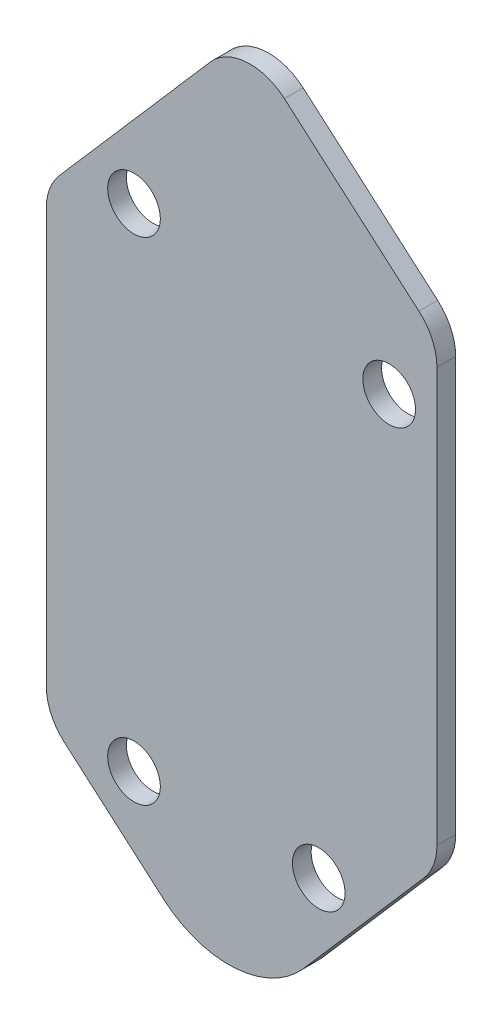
ISO-10303-21;
HEADER;
FILE_DESCRIPTION(('STEP AP214'),'2;1');
FILE_NAME('part.step','',(''),(''),'','','');
FILE_SCHEMA(('AUTOMOTIVE_DESIGN { 1 0 10303 214 1 1 1 1 }'));
ENDSEC;
DATA;
#1=APPLICATION_CONTEXT('core data for automotive mechanical design processes');
#2=APPLICATION_PROTOCOL_DEFINITION('international standard','automotive_design',2000,#1);
#3=PRODUCT_CONTEXT('',#1,'mechanical');
#4=PRODUCT('Part','Part','',(#3));
#5=PRODUCT_RELATED_PRODUCT_CATEGORY('part','',(#4));
#6=PRODUCT_DEFINITION_FORMATION('','',#4);
#7=PRODUCT_DEFINITION_CONTEXT('part definition',#1,'design');
#8=PRODUCT_DEFINITION('design','',#6,#7);
#9=PRODUCT_DEFINITION_SHAPE('','',#8);
#10=(LENGTH_UNIT() NAMED_UNIT(*) SI_UNIT(.MILLI.,.METRE.));
#11=(NAMED_UNIT(*) PLANE_ANGLE_UNIT() SI_UNIT($,.RADIAN.));
#12=(NAMED_UNIT(*) SI_UNIT($,.STERADIAN.) SOLID_ANGLE_UNIT());
#13=UNCERTAINTY_MEASURE_WITH_UNIT(LENGTH_MEASURE(1.E-05),#10,'distance_accuracy_value','');
#14=(GEOMETRIC_REPRESENTATION_CONTEXT(3) GLOBAL_UNCERTAINTY_ASSIGNED_CONTEXT((#13)) GLOBAL_UNIT_ASSIGNED_CONTEXT((#10,
#11,#12)) REPRESENTATION_CONTEXT('',''));
#15=CARTESIAN_POINT('',(0.,0.,0.));
#16=DIRECTION('',(0.,0.,1.));
#17=DIRECTION('',(1.,0.,0.));
#18=AXIS2_PLACEMENT_3D('',#15,#16,#17);
#19=CARTESIAN_POINT('',(-783.463,-50.7534898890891,84.6582));
#20=DIRECTION('',(0.,0.,-1.));
#21=DIRECTION('',(-1.,0.,0.));
#22=AXIS2_PLACEMENT_3D('',#19,#20,#21);
#23=CYLINDRICAL_SURFACE('',#22,7.11199999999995);
#24=CARTESIAN_POINT('',(-783.463,-50.7534898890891,82.1182));
#25=DIRECTION('',(0.,0.,-1.));
#26=DIRECTION('',(-1.,0.,0.));
#27=AXIS2_PLACEMENT_3D('',#24,#25,#26);
#28=CIRCLE('',#27,7.11199999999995);
#29=CARTESIAN_POINT('',(-776.351,-50.7534898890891,82.1182));
#30=VERTEX_POINT('',#29);
#31=CARTESIAN_POINT('',(-778.093225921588,-55.4167580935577,82.1182));
#32=VERTEX_POINT('',#31);
#33=EDGE_CURVE('E175',#30,#32,#28,.T.);
#34=ORIENTED_EDGE('',*,*,#33,.F.);
#35=DIRECTION('',(0.,0.,-1.));
#36=VECTOR('',#35,1.);
#37=CARTESIAN_POINT('',(-776.351,-50.7534898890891,84.6582));
#38=LINE('',#37,#36);
#39=CARTESIAN_POINT('',(-776.351,-50.7534898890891,84.6582));
#40=VERTEX_POINT('',#39);
#41=EDGE_CURVE('E11',#40,#30,#38,.T.);
#42=ORIENTED_EDGE('',*,*,#41,.F.);
#43=CARTESIAN_POINT('',(-783.463,-50.7534898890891,84.6582));
#44=DIRECTION('',(0.,0.,-1.));
#45=DIRECTION('',(-1.,0.,0.));
#46=AXIS2_PLACEMENT_3D('',#43,#44,#45);
#47=CIRCLE('',#46,7.11199999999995);
#48=CARTESIAN_POINT('',(-778.093225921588,-55.4167580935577,84.6582));
#49=VERTEX_POINT('',#48);
#50=EDGE_CURVE('E220',#40,#49,#47,.T.);
#51=ORIENTED_EDGE('',*,*,#50,.T.);
#52=DIRECTION('',(0.,0.,-1.));
#53=VECTOR('',#52,1.);
#54=CARTESIAN_POINT('',(-778.093225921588,-55.4167580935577,84.6582));
#55=LINE('',#54,#53);
#56=EDGE_CURVE('E50',#49,#32,#55,.T.);
#57=ORIENTED_EDGE('',*,*,#56,.T.);
#58=EDGE_LOOP('',(#34,#42,#51,#57));
#59=FACE_BOUND('',#58,.T.);
#60=ADVANCED_FACE('F47',(#59),#23,.T.);
#61=CARTESIAN_POINT('',(-776.351,5.39033140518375,84.6582));
#62=DIRECTION('',(1.,0.,0.));
#63=DIRECTION('',(0.,1.,0.));
#64=AXIS2_PLACEMENT_3D('',#61,#62,#63);
#65=PLANE('',#64);
#66=DIRECTION('',(0.,-1.,0.));
#67=VECTOR('',#66,1.);
#68=CARTESIAN_POINT('',(-776.351,5.39033140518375,82.1182));
#69=LINE('',#68,#67);
#70=CARTESIAN_POINT('',(-776.351,5.39033140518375,82.1182));
#71=VERTEX_POINT('',#70);
#72=EDGE_CURVE('E217',#71,#30,#69,.T.);
#73=ORIENTED_EDGE('',*,*,#72,.F.);
#74=DIRECTION('',(0.,0.,-1.));
#75=VECTOR('',#74,1.);
#76=CARTESIAN_POINT('',(-776.351,5.39033140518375,84.6582));
#77=LINE('',#76,#75);
#78=CARTESIAN_POINT('',(-776.351,5.39033140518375,84.6582));
#79=VERTEX_POINT('',#78);
#80=EDGE_CURVE('E57',#79,#71,#77,.T.);
#81=ORIENTED_EDGE('',*,*,#80,.F.);
#82=DIRECTION('',(0.,-1.,0.));
#83=VECTOR('',#82,1.);
#84=CARTESIAN_POINT('',(-776.351,5.39033140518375,84.6582));
#85=LINE('',#84,#83);
#86=EDGE_CURVE('E160',#79,#40,#85,.T.);
#87=ORIENTED_EDGE('',*,*,#86,.T.);
#88=ORIENTED_EDGE('',*,*,#41,.T.);
#89=EDGE_LOOP('',(#73,#81,#87,#88));
#90=FACE_BOUND('',#89,.T.);
#91=ADVANCED_FACE('F252',(#90),#65,.T.);
#92=CARTESIAN_POINT('',(-783.463,5.39033140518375,84.6582));
#93=DIRECTION('',(0.,0.,-1.));
#94=DIRECTION('',(-1.,0.,0.));
#95=AXIS2_PLACEMENT_3D('',#92,#93,#94);
#96=CYLINDRICAL_SURFACE('',#95,7.11199999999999);
#97=CARTESIAN_POINT('',(-783.463,5.39033140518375,82.1182));
#98=DIRECTION('',(0.,0.,-1.));
#99=DIRECTION('',(-1.,0.,0.));
#100=AXIS2_PLACEMENT_3D('',#97,#98,#99);
#101=CIRCLE('',#100,7.11199999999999);
#102=CARTESIAN_POINT('',(-778.799731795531,10.7601054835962,82.1182));
#103=VERTEX_POINT('',#102);
#104=EDGE_CURVE('E146',#103,#71,#101,.T.);
#105=ORIENTED_EDGE('',*,*,#104,.F.);
#106=DIRECTION('',(0.,0.,-1.));
#107=VECTOR('',#106,1.);
#108=CARTESIAN_POINT('',(-778.799731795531,10.7601054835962,84.6582));
#109=LINE('',#108,#107);
#110=CARTESIAN_POINT('',(-778.799731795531,10.7601054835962,84.6582));
#111=VERTEX_POINT('',#110);
#112=EDGE_CURVE('E141',#111,#103,#109,.T.);
#113=ORIENTED_EDGE('',*,*,#112,.F.);
#114=CARTESIAN_POINT('',(-783.463,5.39033140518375,84.6582));
#115=DIRECTION('',(0.,0.,-1.));
#116=DIRECTION('',(-1.,0.,0.));
#117=AXIS2_PLACEMENT_3D('',#114,#115,#116);
#118=CIRCLE('',#117,7.11199999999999);
#119=EDGE_CURVE('E144',#111,#79,#118,.T.);
#120=ORIENTED_EDGE('',*,*,#119,.T.);
#121=ORIENTED_EDGE('',*,*,#80,.T.);
#122=EDGE_LOOP('',(#105,#113,#120,#121));
#123=FACE_BOUND('',#122,.T.);
#124=ADVANCED_FACE('F143',(#123),#96,.T.);
#125=CARTESIAN_POINT('',(-797.031481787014,26.5930881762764,84.6582));
#126=DIRECTION('',(0.655690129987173,0.755030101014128,0.));
#127=DIRECTION('',(-0.755030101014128,0.655690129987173,0.));
#128=AXIS2_PLACEMENT_3D('',#125,#126,#127);
#129=PLANE('',#128);
#130=DIRECTION('',(0.755030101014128,-0.655690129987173,0.));
#131=VECTOR('',#130,1.);
#132=CARTESIAN_POINT('',(-797.031481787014,26.5930881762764,82.1182));
#133=LINE('',#132,#131);
#134=CARTESIAN_POINT('',(-797.031481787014,26.5930881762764,82.1182));
#135=VERTEX_POINT('',#134);
#136=EDGE_CURVE('E212',#135,#103,#133,.T.);
#137=ORIENTED_EDGE('',*,*,#136,.F.);
#138=DIRECTION('',(0.,0.,-1.));
#139=VECTOR('',#138,1.);
#140=CARTESIAN_POINT('',(-797.031481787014,26.5930881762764,84.6582));
#141=LINE('',#140,#139);
#142=CARTESIAN_POINT('',(-797.031481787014,26.5930881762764,84.6582));
#143=VERTEX_POINT('',#142);
#144=EDGE_CURVE('E152',#143,#135,#141,.T.);
#145=ORIENTED_EDGE('',*,*,#144,.F.);
#146=DIRECTION('',(0.755030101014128,-0.655690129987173,0.));
#147=VECTOR('',#146,1.);
#148=CARTESIAN_POINT('',(-797.031481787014,26.5930881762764,84.6582));
#149=LINE('',#148,#147);
#150=EDGE_CURVE('E158',#143,#111,#149,.T.);
#151=ORIENTED_EDGE('',*,*,#150,.T.);
#152=ORIENTED_EDGE('',*,*,#112,.T.);
#153=EDGE_LOOP('',(#137,#145,#151,#152));
#154=FACE_BOUND('',#153,.T.);
#155=ADVANCED_FACE('F163',(#154),#129,.T.);
#156=CARTESIAN_POINT('',(-801.694749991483,21.2233140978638,84.6582));
#157=DIRECTION('',(0.,0.,-1.));
#158=DIRECTION('',(-1.,0.,0.));
#159=AXIS2_PLACEMENT_3D('',#156,#157,#158);
#160=CYLINDRICAL_SURFACE('',#159,7.11200000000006);
#161=CARTESIAN_POINT('',(-801.694749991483,21.2233140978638,82.1182));
#162=DIRECTION('',(0.,0.,-1.));
#163=DIRECTION('',(-1.,0.,0.));
#164=AXIS2_PLACEMENT_3D('',#161,#162,#163);
#165=CIRCLE('',#164,7.11200000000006);
#166=CARTESIAN_POINT('',(-807.064524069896,25.8865823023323,82.1182));
#167=VERTEX_POINT('',#166);
#168=EDGE_CURVE('E208',#167,#135,#165,.T.);
#169=ORIENTED_EDGE('',*,*,#168,.F.);
#170=DIRECTION('',(0.,0.,-1.));
#171=VECTOR('',#170,1.);
#172=CARTESIAN_POINT('',(-807.064524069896,25.8865823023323,84.6582));
#173=LINE('',#172,#171);
#174=CARTESIAN_POINT('',(-807.064524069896,25.8865823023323,84.6582));
#175=VERTEX_POINT('',#174);
#176=EDGE_CURVE('E226',#175,#167,#173,.T.);
#177=ORIENTED_EDGE('',*,*,#176,.F.);
#178=CARTESIAN_POINT('',(-801.694749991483,21.2233140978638,84.6582));
#179=DIRECTION('',(0.,0.,-1.));
#180=DIRECTION('',(-1.,0.,0.));
#181=AXIS2_PLACEMENT_3D('',#178,#179,#180);
#182=CIRCLE('',#181,7.11200000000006);
#183=EDGE_CURVE('E165',#175,#143,#182,.T.);
#184=ORIENTED_EDGE('',*,*,#183,.T.);
#185=ORIENTED_EDGE('',*,*,#144,.T.);
#186=EDGE_LOOP('',(#169,#177,#184,#185));
#187=FACE_BOUND('',#186,.T.);
#188=ADVANCED_FACE('F265',(#187),#160,.T.);
#189=CARTESIAN_POINT('',(-827.567774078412,2.27699872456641,84.6582));
#190=DIRECTION('',(-0.755030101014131,0.655690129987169,0.));
#191=DIRECTION('',(-0.655690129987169,-0.755030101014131,0.));
#192=AXIS2_PLACEMENT_3D('',#189,#190,#191);
#193=PLANE('',#192);
#194=DIRECTION('',(0.655690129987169,0.755030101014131,0.));
#195=VECTOR('',#194,1.);
#196=CARTESIAN_POINT('',(-827.567774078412,2.27699872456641,82.1182));
#197=LINE('',#196,#195);
#198=CARTESIAN_POINT('',(-827.567774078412,2.27699872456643,82.1182));
#199=VERTEX_POINT('',#198);
#200=EDGE_CURVE('E204',#199,#167,#197,.T.);
#201=ORIENTED_EDGE('',*,*,#200,.F.);
#202=DIRECTION('',(0.,0.,-1.));
#203=VECTOR('',#202,1.);
#204=CARTESIAN_POINT('',(-827.567774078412,2.27699872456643,84.6582));
#205=LINE('',#204,#203);
#206=CARTESIAN_POINT('',(-827.567774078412,2.27699872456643,84.6582));
#207=VERTEX_POINT('',#206);
#208=EDGE_CURVE('E229',#207,#199,#205,.T.);
#209=ORIENTED_EDGE('',*,*,#208,.F.);
#210=DIRECTION('',(0.655690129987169,0.755030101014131,0.));
#211=VECTOR('',#210,1.);
#212=CARTESIAN_POINT('',(-827.567774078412,2.27699872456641,84.6582));
#213=LINE('',#212,#211);
#214=EDGE_CURVE('E169',#207,#175,#213,.T.);
#215=ORIENTED_EDGE('',*,*,#214,.T.);
#216=ORIENTED_EDGE('',*,*,#176,.T.);
#217=EDGE_LOOP('',(#201,#209,#215,#216));
#218=FACE_BOUND('',#217,.T.);
#219=ADVANCED_FACE('F268',(#218),#193,.T.);
#220=CARTESIAN_POINT('',(-822.198,-2.38626947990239,84.6582));
#221=DIRECTION('',(0.,0.,-1.));
#222=DIRECTION('',(-1.,0.,0.));
#223=AXIS2_PLACEMENT_3D('',#220,#221,#222);
#224=CYLINDRICAL_SURFACE('',#223,7.11200000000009);
#225=CARTESIAN_POINT('',(-822.198,-2.38626947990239,82.1182));
#226=DIRECTION('',(0.,0.,-1.));
#227=DIRECTION('',(-1.,0.,0.));
#228=AXIS2_PLACEMENT_3D('',#225,#226,#227);
#229=CIRCLE('',#228,7.11200000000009);
#230=CARTESIAN_POINT('',(-829.31,-2.38626947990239,82.1182));
#231=VERTEX_POINT('',#230);
#232=EDGE_CURVE('E200',#231,#199,#229,.T.);
#233=ORIENTED_EDGE('',*,*,#232,.F.);
#234=DIRECTION('',(0.,0.,-1.));
#235=VECTOR('',#234,1.);
#236=CARTESIAN_POINT('',(-829.31,-2.38626947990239,84.6582));
#237=LINE('',#236,#235);
#238=CARTESIAN_POINT('',(-829.31,-2.38626947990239,84.6582));
#239=VERTEX_POINT('',#238);
#240=EDGE_CURVE('E232',#239,#231,#237,.T.);
#241=ORIENTED_EDGE('',*,*,#240,.F.);
#242=CARTESIAN_POINT('',(-822.198,-2.38626947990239,84.6582));
#243=DIRECTION('',(0.,0.,-1.));
#244=DIRECTION('',(-1.,0.,0.));
#245=AXIS2_PLACEMENT_3D('',#242,#243,#244);
#246=CIRCLE('',#245,7.11200000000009);
#247=EDGE_CURVE('E377',#239,#207,#246,.T.);
#248=ORIENTED_EDGE('',*,*,#247,.T.);
#249=ORIENTED_EDGE('',*,*,#208,.T.);
#250=EDGE_LOOP('',(#233,#241,#248,#249));
#251=FACE_BOUND('',#250,.T.);
#252=ADVANCED_FACE('F272',(#251),#224,.T.);
#253=CARTESIAN_POINT('',(-829.31,-58.5300907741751,84.6582));
#254=DIRECTION('',(-1.,0.,0.));
#255=DIRECTION('',(0.,-1.,0.));
#256=AXIS2_PLACEMENT_3D('',#253,#254,#255);
#257=PLANE('',#256);
#258=DIRECTION('',(0.,1.,0.));
#259=VECTOR('',#258,1.);
#260=CARTESIAN_POINT('',(-829.31,-58.5300907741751,82.1182));
#261=LINE('',#260,#259);
#262=CARTESIAN_POINT('',(-829.31,-58.5300907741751,82.1182));
#263=VERTEX_POINT('',#262);
#264=EDGE_CURVE('E196',#263,#231,#261,.T.);
#265=ORIENTED_EDGE('',*,*,#264,.F.);
#266=DIRECTION('',(0.,0.,-1.));
#267=VECTOR('',#266,1.);
#268=CARTESIAN_POINT('',(-829.31,-58.5300907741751,84.6582));
#269=LINE('',#268,#267);
#270=CARTESIAN_POINT('',(-829.31,-58.5300907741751,84.6582));
#271=VERTEX_POINT('',#270);
#272=EDGE_CURVE('E235',#271,#263,#269,.T.);
#273=ORIENTED_EDGE('',*,*,#272,.F.);
#274=DIRECTION('',(0.,1.,0.));
#275=VECTOR('',#274,1.);
#276=CARTESIAN_POINT('',(-829.31,-58.5300907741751,84.6582));
#277=LINE('',#276,#275);
#278=EDGE_CURVE('E373',#271,#239,#277,.T.);
#279=ORIENTED_EDGE('',*,*,#278,.T.);
#280=ORIENTED_EDGE('',*,*,#240,.T.);
#281=EDGE_LOOP('',(#265,#273,#279,#280));
#282=FACE_BOUND('',#281,.T.);
#283=ADVANCED_FACE('F276',(#282),#257,.T.);
#284=CARTESIAN_POINT('',(-822.198,-58.5300907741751,84.6582));
#285=DIRECTION('',(0.,0.,-1.));
#286=DIRECTION('',(-1.,0.,0.));
#287=AXIS2_PLACEMENT_3D('',#284,#285,#286);
#288=CYLINDRICAL_SURFACE('',#287,7.11199999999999);
#289=CARTESIAN_POINT('',(-822.198,-58.5300907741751,82.1182));
#290=DIRECTION('',(0.,0.,-1.));
#291=DIRECTION('',(-1.,0.,0.));
#292=AXIS2_PLACEMENT_3D('',#289,#290,#291);
#293=CIRCLE('',#292,7.11199999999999);
#294=CARTESIAN_POINT('',(-826.861268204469,-63.8998648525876,82.1182));
#295=VERTEX_POINT('',#294);
#296=EDGE_CURVE('E192',#295,#263,#293,.T.);
#297=ORIENTED_EDGE('',*,*,#296,.F.);
#298=DIRECTION('',(0.,0.,-1.));
#299=VECTOR('',#298,1.);
#300=CARTESIAN_POINT('',(-826.861268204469,-63.8998648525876,84.6582));
#301=LINE('',#300,#299);
#302=CARTESIAN_POINT('',(-826.861268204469,-63.8998648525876,84.6582));
#303=VERTEX_POINT('',#302);
#304=EDGE_CURVE('E238',#303,#295,#301,.T.);
#305=ORIENTED_EDGE('',*,*,#304,.F.);
#306=CARTESIAN_POINT('',(-822.198,-58.5300907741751,84.6582));
#307=DIRECTION('',(0.,0.,-1.));
#308=DIRECTION('',(-1.,0.,0.));
#309=AXIS2_PLACEMENT_3D('',#306,#307,#308);
#310=CIRCLE('',#309,7.11199999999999);
#311=EDGE_CURVE('E369',#303,#271,#310,.T.);
#312=ORIENTED_EDGE('',*,*,#311,.T.);
#313=ORIENTED_EDGE('',*,*,#272,.T.);
#314=EDGE_LOOP('',(#297,#305,#312,#313));
#315=FACE_BOUND('',#314,.T.);
#316=ADVANCED_FACE('F280',(#315),#288,.T.);
#317=CARTESIAN_POINT('',(-813.423959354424,-75.5692152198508,84.6582));
#318=DIRECTION('',(-0.655690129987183,-0.755030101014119,0.));
#319=DIRECTION('',(0.755030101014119,-0.655690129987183,0.));
#320=AXIS2_PLACEMENT_3D('',#317,#318,#319);
#321=PLANE('',#320);
#322=DIRECTION('',(-0.755030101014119,0.655690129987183,0.));
#323=VECTOR('',#322,1.);
#324=CARTESIAN_POINT('',(-813.423959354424,-75.5692152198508,82.1182));
#325=LINE('',#324,#323);
#326=CARTESIAN_POINT('',(-813.423959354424,-75.5692152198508,82.1182));
#327=VERTEX_POINT('',#326);
#328=EDGE_CURVE('E188',#327,#295,#325,.T.);
#329=ORIENTED_EDGE('',*,*,#328,.F.);
#330=DIRECTION('',(0.,0.,-1.));
#331=VECTOR('',#330,1.);
#332=CARTESIAN_POINT('',(-813.423959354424,-75.5692152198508,84.6582));
#333=LINE('',#332,#331);
#334=CARTESIAN_POINT('',(-813.423959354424,-75.5692152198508,84.6582));
#335=VERTEX_POINT('',#334);
#336=EDGE_CURVE('E241',#335,#327,#333,.T.);
#337=ORIENTED_EDGE('',*,*,#336,.F.);
#338=DIRECTION('',(-0.755030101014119,0.655690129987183,0.));
#339=VECTOR('',#338,1.);
#340=CARTESIAN_POINT('',(-813.423959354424,-75.5692152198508,84.6582));
#341=LINE('',#340,#339);
#342=EDGE_CURVE('E365',#335,#303,#341,.T.);
#343=ORIENTED_EDGE('',*,*,#342,.T.);
#344=ORIENTED_EDGE('',*,*,#304,.T.);
#345=EDGE_LOOP('',(#329,#337,#343,#344));
#346=FACE_BOUND('',#345,.T.);
#347=ADVANCED_FACE('F284',(#346),#321,.T.);
#348=CARTESIAN_POINT('',(-804.597058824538,-65.405,84.6582));
#349=DIRECTION('',(0.,0.,-1.));
#350=DIRECTION('',(-1.,0.,0.));
#351=AXIS2_PLACEMENT_3D('',#348,#349,#350);
#352=CYLINDRICAL_SURFACE('',#351,13.4619999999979);
#353=CARTESIAN_POINT('',(-804.597058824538,-65.405,82.1182));
#354=DIRECTION('',(0.,0.,-1.));
#355=DIRECTION('',(-1.,0.,0.));
#356=AXIS2_PLACEMENT_3D('',#353,#354,#355);
#357=CIRCLE('',#356,13.4619999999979);
#358=CARTESIAN_POINT('',(-794.432843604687,-74.2319005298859,82.1182));
#359=VERTEX_POINT('',#358);
#360=EDGE_CURVE('E184',#359,#327,#357,.T.);
#361=ORIENTED_EDGE('',*,*,#360,.F.);
#362=DIRECTION('',(0.,0.,-1.));
#363=VECTOR('',#362,1.);
#364=CARTESIAN_POINT('',(-794.432843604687,-74.2319005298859,84.6582));
#365=LINE('',#364,#363);
#366=CARTESIAN_POINT('',(-794.432843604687,-74.2319005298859,84.6582));
#367=VERTEX_POINT('',#366);
#368=EDGE_CURVE('E243',#367,#359,#365,.T.);
#369=ORIENTED_EDGE('',*,*,#368,.F.);
#370=CARTESIAN_POINT('',(-804.597058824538,-65.405,84.6582));
#371=DIRECTION('',(0.,0.,-1.));
#372=DIRECTION('',(-1.,0.,0.));
#373=AXIS2_PLACEMENT_3D('',#370,#371,#372);
#374=CIRCLE('',#373,13.4619999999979);
#375=EDGE_CURVE('E361',#367,#335,#374,.T.);
#376=ORIENTED_EDGE('',*,*,#375,.T.);
#377=ORIENTED_EDGE('',*,*,#336,.T.);
#378=EDGE_LOOP('',(#361,#369,#376,#377));
#379=FACE_BOUND('',#378,.T.);
#380=ADVANCED_FACE('F288',(#379),#352,.T.);
#381=CARTESIAN_POINT('',(-778.093225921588,-55.4167580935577,84.6582));
#382=DIRECTION('',(0.755030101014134,-0.655690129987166,0.));
#383=DIRECTION('',(0.655690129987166,0.755030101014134,0.));
#384=AXIS2_PLACEMENT_3D('',#381,#382,#383);
#385=PLANE('',#384);
#386=DIRECTION('',(-0.655690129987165,-0.755030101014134,0.));
#387=VECTOR('',#386,1.);
#388=CARTESIAN_POINT('',(-778.093225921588,-55.4167580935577,82.1182));
#389=LINE('',#388,#387);
#390=EDGE_CURVE('E179',#32,#359,#389,.T.);
#391=ORIENTED_EDGE('',*,*,#390,.F.);
#392=ORIENTED_EDGE('',*,*,#56,.F.);
#393=DIRECTION('',(-0.655690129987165,-0.755030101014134,0.));
#394=VECTOR('',#393,1.);
#395=CARTESIAN_POINT('',(-778.093225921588,-55.4167580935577,84.6582));
#396=LINE('',#395,#394);
#397=EDGE_CURVE('E358',#49,#367,#396,.T.);
#398=ORIENTED_EDGE('',*,*,#397,.T.);
#399=ORIENTED_EDGE('',*,*,#368,.T.);
#400=EDGE_LOOP('',(#391,#392,#398,#399));
#401=FACE_BOUND('',#400,.T.);
#402=ADVANCED_FACE('F249',(#401),#385,.T.);
#403=CARTESIAN_POINT('',(-783.463,-50.7534898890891,84.6582));
#404=DIRECTION('',(0.,0.,-1.));
#405=DIRECTION('',(-1.,0.,0.));
#406=AXIS2_PLACEMENT_3D('',#403,#404,#405);
#407=PLANE('',#406);
#408=CARTESIAN_POINT('',(-782.828,-1.00168590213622,84.6582));
#409=DIRECTION('',(0.,0.,-1.));
#410=DIRECTION('',(-1.,0.,0.));
#411=AXIS2_PLACEMENT_3D('',#408,#409,#410);
#412=CIRCLE('',#411,3.56869999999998);
#413=CARTESIAN_POINT('',(-786.3967,-1.00168590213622,84.6582));
#414=VERTEX_POINT('',#413);
#415=EDGE_CURVE('E323',#414,#414,#412,.T.);
#416=ORIENTED_EDGE('',*,*,#415,.T.);
#417=EDGE_LOOP('',(#416));
#418=FACE_BOUND('',#417,.T.);
#419=CARTESIAN_POINT('',(-817.424993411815,4.07831409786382,84.6582));
#420=DIRECTION('',(0.,0.,-1.));
#421=DIRECTION('',(-1.,0.,0.));
#422=AXIS2_PLACEMENT_3D('',#419,#420,#421);
#423=CIRCLE('',#422,3.56869999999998);
#424=CARTESIAN_POINT('',(-820.993693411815,4.07831409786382,84.6582));
#425=VERTEX_POINT('',#424);
#426=EDGE_CURVE('E328',#425,#425,#423,.T.);
#427=ORIENTED_EDGE('',*,*,#426,.T.);
#428=EDGE_LOOP('',(#427));
#429=FACE_BOUND('',#428,.T.);
#430=CARTESIAN_POINT('',(-792.378161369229,-62.5966859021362,84.6582));
#431=DIRECTION('',(0.,0.,-1.));
#432=DIRECTION('',(-1.,0.,0.));
#433=AXIS2_PLACEMENT_3D('',#430,#431,#432);
#434=CIRCLE('',#433,3.56869999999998);
#435=CARTESIAN_POINT('',(-795.946861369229,-62.5966859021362,84.6582));
#436=VERTEX_POINT('',#435);
#437=EDGE_CURVE('E341',#436,#436,#434,.T.);
#438=ORIENTED_EDGE('',*,*,#437,.T.);
#439=EDGE_LOOP('',(#438));
#440=FACE_BOUND('',#439,.T.);
#441=CARTESIAN_POINT('',(-817.424993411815,-62.5966859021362,84.6582));
#442=DIRECTION('',(0.,0.,-1.));
#443=DIRECTION('',(-1.,0.,0.));
#444=AXIS2_PLACEMENT_3D('',#441,#442,#443);
#445=CIRCLE('',#444,3.56869999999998);
#446=CARTESIAN_POINT('',(-820.993693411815,-62.5966859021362,84.6582));
#447=VERTEX_POINT('',#446);
#448=EDGE_CURVE('E349',#447,#447,#445,.T.);
#449=ORIENTED_EDGE('',*,*,#448,.T.);
#450=EDGE_LOOP('',(#449));
#451=FACE_BOUND('',#450,.T.);
#452=ORIENTED_EDGE('',*,*,#50,.F.);
#453=ORIENTED_EDGE('',*,*,#86,.F.);
#454=ORIENTED_EDGE('',*,*,#119,.F.);
#455=ORIENTED_EDGE('',*,*,#150,.F.);
#456=ORIENTED_EDGE('',*,*,#183,.F.);
#457=ORIENTED_EDGE('',*,*,#214,.F.);
#458=ORIENTED_EDGE('',*,*,#247,.F.);
#459=ORIENTED_EDGE('',*,*,#278,.F.);
#460=ORIENTED_EDGE('',*,*,#311,.F.);
#461=ORIENTED_EDGE('',*,*,#342,.F.);
#462=ORIENTED_EDGE('',*,*,#375,.F.);
#463=ORIENTED_EDGE('',*,*,#397,.F.);
#464=EDGE_LOOP('',(#452,#453,#454,#455,#456,#457,#458,#459,#460,#461,#462,#463));
#465=FACE_BOUND('',#464,.T.);
#466=ADVANCED_FACE('F156',(#418,#429,#440,#451,#465),#407,.F.);
#467=CARTESIAN_POINT('',(-783.463,-50.7534898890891,82.1182));
#468=DIRECTION('',(0.,0.,-1.));
#469=DIRECTION('',(-1.,0.,0.));
#470=AXIS2_PLACEMENT_3D('',#467,#468,#469);
#471=PLANE('',#470);
#472=CARTESIAN_POINT('',(-782.828,-1.00168590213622,82.1182));
#473=DIRECTION('',(0.,0.,-1.));
#474=DIRECTION('',(-1.,0.,0.));
#475=AXIS2_PLACEMENT_3D('',#472,#473,#474);
#476=CIRCLE('',#475,3.56869999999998);
#477=CARTESIAN_POINT('',(-786.3967,-1.00168590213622,82.1182));
#478=VERTEX_POINT('',#477);
#479=EDGE_CURVE('E326',#478,#478,#476,.T.);
#480=ORIENTED_EDGE('',*,*,#479,.F.);
#481=EDGE_LOOP('',(#480));
#482=FACE_BOUND('',#481,.T.);
#483=CARTESIAN_POINT('',(-817.424993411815,4.07831409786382,82.1182));
#484=DIRECTION('',(0.,0.,-1.));
#485=DIRECTION('',(-1.,0.,0.));
#486=AXIS2_PLACEMENT_3D('',#483,#484,#485);
#487=CIRCLE('',#486,3.56869999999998);
#488=CARTESIAN_POINT('',(-820.993693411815,4.07831409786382,82.1182));
#489=VERTEX_POINT('',#488);
#490=EDGE_CURVE('E334',#489,#489,#487,.T.);
#491=ORIENTED_EDGE('',*,*,#490,.F.);
#492=EDGE_LOOP('',(#491));
#493=FACE_BOUND('',#492,.T.);
#494=CARTESIAN_POINT('',(-792.378161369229,-62.5966859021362,82.1182));
#495=DIRECTION('',(0.,0.,-1.));
#496=DIRECTION('',(-1.,0.,0.));
#497=AXIS2_PLACEMENT_3D('',#494,#495,#496);
#498=CIRCLE('',#497,3.56869999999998);
#499=CARTESIAN_POINT('',(-795.946861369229,-62.5966859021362,82.1182));
#500=VERTEX_POINT('',#499);
#501=EDGE_CURVE('E345',#500,#500,#498,.T.);
#502=ORIENTED_EDGE('',*,*,#501,.F.);
#503=EDGE_LOOP('',(#502));
#504=FACE_BOUND('',#503,.T.);
#505=CARTESIAN_POINT('',(-817.424993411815,-62.5966859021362,82.1182));
#506=DIRECTION('',(0.,0.,-1.));
#507=DIRECTION('',(-1.,0.,0.));
#508=AXIS2_PLACEMENT_3D('',#505,#506,#507);
#509=CIRCLE('',#508,3.56869999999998);
#510=CARTESIAN_POINT('',(-820.993693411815,-62.5966859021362,82.1182));
#511=VERTEX_POINT('',#510);
#512=EDGE_CURVE('E180',#511,#511,#509,.T.);
#513=ORIENTED_EDGE('',*,*,#512,.F.);
#514=EDGE_LOOP('',(#513));
#515=FACE_BOUND('',#514,.T.);
#516=ORIENTED_EDGE('',*,*,#33,.T.);
#517=ORIENTED_EDGE('',*,*,#390,.T.);
#518=ORIENTED_EDGE('',*,*,#360,.T.);
#519=ORIENTED_EDGE('',*,*,#328,.T.);
#520=ORIENTED_EDGE('',*,*,#296,.T.);
#521=ORIENTED_EDGE('',*,*,#264,.T.);
#522=ORIENTED_EDGE('',*,*,#232,.T.);
#523=ORIENTED_EDGE('',*,*,#200,.T.);
#524=ORIENTED_EDGE('',*,*,#168,.T.);
#525=ORIENTED_EDGE('',*,*,#136,.T.);
#526=ORIENTED_EDGE('',*,*,#104,.T.);
#527=ORIENTED_EDGE('',*,*,#72,.T.);
#528=EDGE_LOOP('',(#516,#517,#518,#519,#520,#521,#522,#523,#524,#525,#526,#527));
#529=FACE_BOUND('',#528,.T.);
#530=ADVANCED_FACE('F251',(#482,#493,#504,#515,#529),#471,.T.);
#531=CARTESIAN_POINT('',(-817.424993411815,-62.5966859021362,82.1182));
#532=DIRECTION('',(0.,0.,-1.));
#533=DIRECTION('',(-1.,0.,0.));
#534=AXIS2_PLACEMENT_3D('',#531,#532,#533);
#535=CYLINDRICAL_SURFACE('',#534,3.56869999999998);
#536=ORIENTED_EDGE('',*,*,#448,.F.);
#537=EDGE_LOOP('',(#536));
#538=FACE_BOUND('',#537,.T.);
#539=ORIENTED_EDGE('',*,*,#512,.T.);
#540=EDGE_LOOP('',(#539));
#541=FACE_BOUND('',#540,.T.);
#542=ADVANCED_FACE('F300',(#538,#541),#535,.F.);
#543=CARTESIAN_POINT('',(-792.378161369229,-62.5966859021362,82.1182));
#544=DIRECTION('',(0.,0.,-1.));
#545=DIRECTION('',(-1.,0.,0.));
#546=AXIS2_PLACEMENT_3D('',#543,#544,#545);
#547=CYLINDRICAL_SURFACE('',#546,3.56869999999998);
#548=ORIENTED_EDGE('',*,*,#437,.F.);
#549=EDGE_LOOP('',(#548));
#550=FACE_BOUND('',#549,.T.);
#551=ORIENTED_EDGE('',*,*,#501,.T.);
#552=EDGE_LOOP('',(#551));
#553=FACE_BOUND('',#552,.T.);
#554=ADVANCED_FACE('F307',(#550,#553),#547,.F.);
#555=CARTESIAN_POINT('',(-817.424993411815,4.07831409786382,82.1182));
#556=DIRECTION('',(0.,0.,-1.));
#557=DIRECTION('',(-1.,0.,0.));
#558=AXIS2_PLACEMENT_3D('',#555,#556,#557);
#559=CYLINDRICAL_SURFACE('',#558,3.56869999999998);
#560=ORIENTED_EDGE('',*,*,#426,.F.);
#561=EDGE_LOOP('',(#560));
#562=FACE_BOUND('',#561,.T.);
#563=ORIENTED_EDGE('',*,*,#490,.T.);
#564=EDGE_LOOP('',(#563));
#565=FACE_BOUND('',#564,.T.);
#566=ADVANCED_FACE('F311',(#562,#565),#559,.F.);
#567=CARTESIAN_POINT('',(-782.828,-1.00168590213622,82.1182));
#568=DIRECTION('',(0.,0.,-1.));
#569=DIRECTION('',(-1.,0.,0.));
#570=AXIS2_PLACEMENT_3D('',#567,#568,#569);
#571=CYLINDRICAL_SURFACE('',#570,3.56869999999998);
#572=ORIENTED_EDGE('',*,*,#415,.F.);
#573=EDGE_LOOP('',(#572));
#574=FACE_BOUND('',#573,.T.);
#575=ORIENTED_EDGE('',*,*,#479,.T.);
#576=EDGE_LOOP('',(#575));
#577=FACE_BOUND('',#576,.T.);
#578=ADVANCED_FACE('F315',(#574,#577),#571,.F.);
#579=CLOSED_SHELL('',(#60,#91,#124,#155,#188,#219,#252,#283,#316,#347,#380,#402,#466,#530,#542,
#554,#566,#578));
#580=MANIFOLD_SOLID_BREP('B2',#579);
#581=ADVANCED_BREP_SHAPE_REPRESENTATION('',(#18,#580),#14);
#582=SHAPE_DEFINITION_REPRESENTATION(#9,#581);
ENDSEC;
END-ISO-10303-21;
